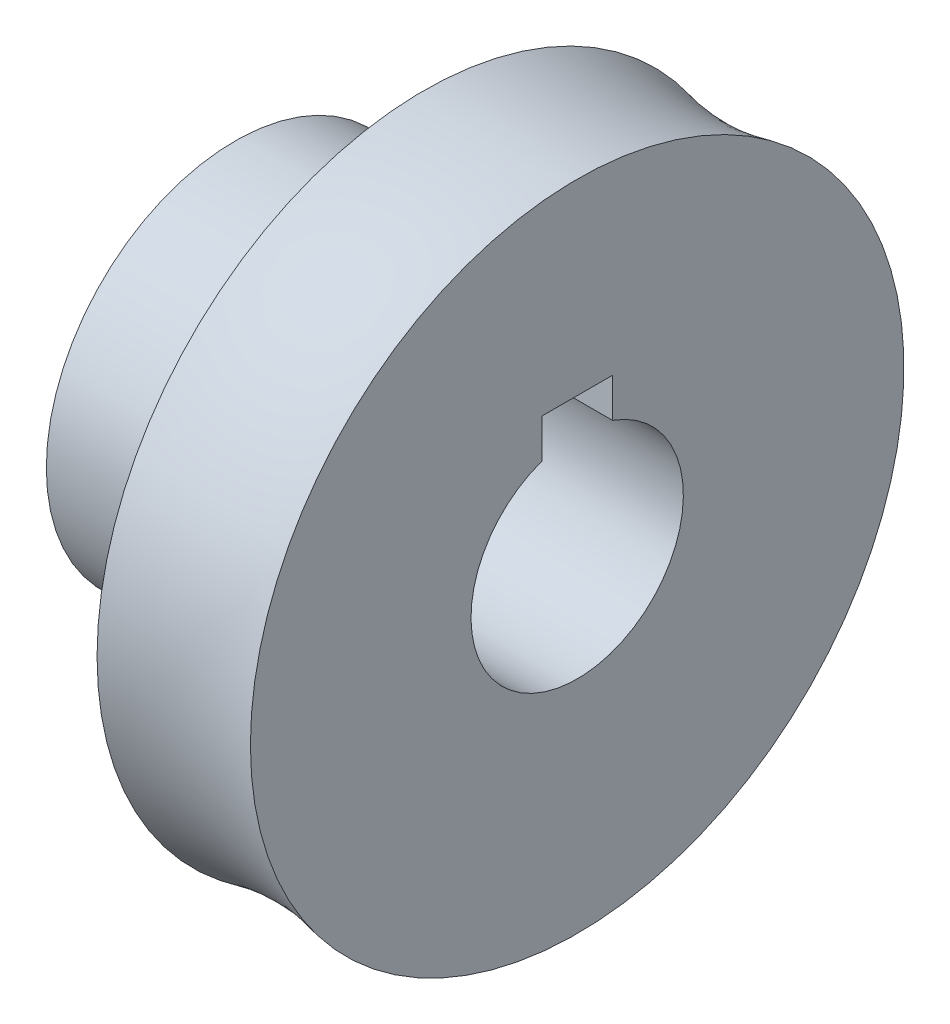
ISO-10303-21;
HEADER;
FILE_DESCRIPTION(('STEP AP214'),'2;1');
FILE_NAME('part.step','',(''),(''),'','','');
FILE_SCHEMA(('AUTOMOTIVE_DESIGN { 1 0 10303 214 1 1 1 1 }'));
ENDSEC;
DATA;
#1=APPLICATION_CONTEXT('core data for automotive mechanical design processes');
#2=APPLICATION_PROTOCOL_DEFINITION('international standard','automotive_design',2000,#1);
#3=PRODUCT_CONTEXT('',#1,'mechanical');
#4=PRODUCT('Part','Part','',(#3));
#5=PRODUCT_RELATED_PRODUCT_CATEGORY('part','',(#4));
#6=PRODUCT_DEFINITION_FORMATION('','',#4);
#7=PRODUCT_DEFINITION_CONTEXT('part definition',#1,'design');
#8=PRODUCT_DEFINITION('design','',#6,#7);
#9=PRODUCT_DEFINITION_SHAPE('','',#8);
#10=(LENGTH_UNIT() NAMED_UNIT(*) SI_UNIT(.MILLI.,.METRE.));
#11=(NAMED_UNIT(*) PLANE_ANGLE_UNIT() SI_UNIT($,.RADIAN.));
#12=(NAMED_UNIT(*) SI_UNIT($,.STERADIAN.) SOLID_ANGLE_UNIT());
#13=UNCERTAINTY_MEASURE_WITH_UNIT(LENGTH_MEASURE(1.E-05),#10,'distance_accuracy_value','');
#14=(GEOMETRIC_REPRESENTATION_CONTEXT(3) GLOBAL_UNCERTAINTY_ASSIGNED_CONTEXT((#13)) GLOBAL_UNIT_ASSIGNED_CONTEXT((#10,
#11,#12)) REPRESENTATION_CONTEXT('',''));
#15=CARTESIAN_POINT('',(0.,0.,0.));
#16=DIRECTION('',(0.,0.,1.));
#17=DIRECTION('',(1.,0.,0.));
#18=AXIS2_PLACEMENT_3D('',#15,#16,#17);
#19=CARTESIAN_POINT('',(0.,4.5,0.));
#20=DIRECTION('',(1.,0.,0.));
#21=DIRECTION('',(0.,0.,-1.));
#22=AXIS2_PLACEMENT_3D('',#19,#20,#21);
#23=PLANE('',#22);
#24=DIRECTION('',(0.,0.,1.));
#25=VECTOR('',#24,1.);
#26=CARTESIAN_POINT('',(0.,5.9,1.5));
#27=LINE('',#26,#25);
#28=CARTESIAN_POINT('',(0.,5.9,-1.5));
#29=VERTEX_POINT('',#28);
#30=CARTESIAN_POINT('',(0.,5.9,1.5));
#31=VERTEX_POINT('',#30);
#32=EDGE_CURVE('E87',#29,#31,#27,.T.);
#33=ORIENTED_EDGE('',*,*,#32,.T.);
#34=DIRECTION('',(0.,-1.,0.));
#35=VECTOR('',#34,1.);
#36=CARTESIAN_POINT('',(0.,5.9,1.5));
#37=LINE('',#36,#35);
#38=CARTESIAN_POINT('',(0.,4.24264068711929,1.5));
#39=VERTEX_POINT('',#38);
#40=EDGE_CURVE('E93',#31,#39,#37,.T.);
#41=ORIENTED_EDGE('',*,*,#40,.T.);
#42=CARTESIAN_POINT('',(0.,0.,0.));
#43=DIRECTION('',(-1.,0.,0.));
#44=DIRECTION('',(0.,0.,1.));
#45=AXIS2_PLACEMENT_3D('',#42,#43,#44);
#46=CIRCLE('',#45,4.5);
#47=CARTESIAN_POINT('',(0.,4.24264068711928,-1.5));
#48=VERTEX_POINT('',#47);
#49=EDGE_CURVE('E43',#48,#39,#46,.T.);
#50=ORIENTED_EDGE('',*,*,#49,.F.);
#51=DIRECTION('',(0.,1.,0.));
#52=VECTOR('',#51,1.);
#53=CARTESIAN_POINT('',(0.,5.9,-1.5));
#54=LINE('',#53,#52);
#55=EDGE_CURVE('E95',#48,#29,#54,.T.);
#56=ORIENTED_EDGE('',*,*,#55,.T.);
#57=EDGE_LOOP('',(#33,#41,#50,#56));
#58=FACE_BOUND('',#57,.T.);
#59=CARTESIAN_POINT('',(0.,0.,0.));
#60=DIRECTION('',(-1.,0.,0.));
#61=DIRECTION('',(0.,0.,1.));
#62=AXIS2_PLACEMENT_3D('',#59,#60,#61);
#63=CIRCLE('',#62,8.);
#64=CARTESIAN_POINT('',(0.,0.,8.));
#65=VERTEX_POINT('',#64);
#66=EDGE_CURVE('E104',#65,#65,#63,.T.);
#67=ORIENTED_EDGE('',*,*,#66,.T.);
#68=EDGE_LOOP('',(#67));
#69=FACE_BOUND('',#68,.T.);
#70=ADVANCED_FACE('F36',(#58,#69),#23,.F.);
#71=CARTESIAN_POINT('',(0.,0.,0.));
#72=DIRECTION('',(-1.,0.,0.));
#73=DIRECTION('',(0.,0.,1.));
#74=AXIS2_PLACEMENT_3D('',#71,#72,#73);
#75=CYLINDRICAL_SURFACE('',#74,4.5);
#76=ORIENTED_EDGE('',*,*,#49,.T.);
#77=DIRECTION('',(-1.,0.,0.));
#78=VECTOR('',#77,1.);
#79=CARTESIAN_POINT('',(0.,4.24264068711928,1.5));
#80=LINE('',#79,#78);
#81=CARTESIAN_POINT('',(14.5,4.24264068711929,1.5));
#82=VERTEX_POINT('',#81);
#83=EDGE_CURVE('E57',#39,#82,#80,.F.);
#84=ORIENTED_EDGE('',*,*,#83,.T.);
#85=CARTESIAN_POINT('',(14.5,0.,0.));
#86=DIRECTION('',(-1.,0.,0.));
#87=DIRECTION('',(0.,0.,1.));
#88=AXIS2_PLACEMENT_3D('',#85,#86,#87);
#89=CIRCLE('',#88,4.5);
#90=CARTESIAN_POINT('',(14.5,4.24264068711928,-1.5));
#91=VERTEX_POINT('',#90);
#92=EDGE_CURVE('E116',#91,#82,#89,.T.);
#93=ORIENTED_EDGE('',*,*,#92,.F.);
#94=DIRECTION('',(-1.,0.,0.));
#95=VECTOR('',#94,1.);
#96=CARTESIAN_POINT('',(0.,4.24264068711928,-1.5));
#97=LINE('',#96,#95);
#98=EDGE_CURVE('E50',#91,#48,#97,.T.);
#99=ORIENTED_EDGE('',*,*,#98,.T.);
#100=EDGE_LOOP('',(#76,#84,#93,#99));
#101=FACE_BOUND('',#100,.T.);
#102=ADVANCED_FACE('F120',(#101),#75,.F.);
#103=CARTESIAN_POINT('',(14.5,4.5,0.));
#104=DIRECTION('',(-1.,0.,0.));
#105=DIRECTION('',(0.,0.,1.));
#106=AXIS2_PLACEMENT_3D('',#103,#104,#105);
#107=PLANE('',#106);
#108=CARTESIAN_POINT('',(14.5,0.,0.));
#109=DIRECTION('',(-1.,0.,0.));
#110=DIRECTION('',(0.,0.,1.));
#111=AXIS2_PLACEMENT_3D('',#108,#109,#110);
#112=CIRCLE('',#111,13.85);
#113=CARTESIAN_POINT('',(14.5,0.,13.85));
#114=VERTEX_POINT('',#113);
#115=EDGE_CURVE('E113',#114,#114,#112,.T.);
#116=ORIENTED_EDGE('',*,*,#115,.F.);
#117=EDGE_LOOP('',(#116));
#118=FACE_BOUND('',#117,.T.);
#119=ORIENTED_EDGE('',*,*,#92,.T.);
#120=DIRECTION('',(0.,-1.,0.));
#121=VECTOR('',#120,1.);
#122=CARTESIAN_POINT('',(14.5,5.9,1.5));
#123=LINE('',#122,#121);
#124=CARTESIAN_POINT('',(14.5,5.9,1.5));
#125=VERTEX_POINT('',#124);
#126=EDGE_CURVE('E92',#125,#82,#123,.T.);
#127=ORIENTED_EDGE('',*,*,#126,.F.);
#128=DIRECTION('',(0.,0.,1.));
#129=VECTOR('',#128,1.);
#130=CARTESIAN_POINT('',(14.5,5.9,1.5));
#131=LINE('',#130,#129);
#132=CARTESIAN_POINT('',(14.5,5.9,-1.5));
#133=VERTEX_POINT('',#132);
#134=EDGE_CURVE('E84',#133,#125,#131,.T.);
#135=ORIENTED_EDGE('',*,*,#134,.F.);
#136=DIRECTION('',(0.,-1.,0.));
#137=VECTOR('',#136,1.);
#138=CARTESIAN_POINT('',(14.5,4.5,-1.5));
#139=LINE('',#138,#137);
#140=EDGE_CURVE('E11',#133,#91,#139,.T.);
#141=ORIENTED_EDGE('',*,*,#140,.T.);
#142=EDGE_LOOP('',(#119,#127,#135,#141));
#143=FACE_BOUND('',#142,.T.);
#144=ADVANCED_FACE('F91',(#118,#143),#107,.F.);
#145=CARTESIAN_POINT('',(11.25,0.,0.));
#146=DIRECTION('',(-1.,0.,0.));
#147=DIRECTION('',(0.,0.,1.));
#148=AXIS2_PLACEMENT_3D('',#145,#146,#147);
#149=TOROIDAL_SURFACE('',#148,27.4675438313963,14.);
#150=CARTESIAN_POINT('',(8.,0.,0.));
#151=DIRECTION('',(-1.,0.,0.));
#152=DIRECTION('',(0.,0.,1.));
#153=AXIS2_PLACEMENT_3D('',#150,#151,#152);
#154=CIRCLE('',#153,13.85);
#155=CARTESIAN_POINT('',(8.,0.,13.85));
#156=VERTEX_POINT('',#155);
#157=EDGE_CURVE('E110',#156,#156,#154,.T.);
#158=ORIENTED_EDGE('',*,*,#157,.F.);
#159=EDGE_LOOP('',(#158));
#160=FACE_BOUND('',#159,.T.);
#161=ORIENTED_EDGE('',*,*,#115,.T.);
#162=EDGE_LOOP('',(#161));
#163=FACE_BOUND('',#162,.T.);
#164=ADVANCED_FACE('F142',(#160,#163),#149,.F.);
#165=CARTESIAN_POINT('',(8.,8.,0.));
#166=DIRECTION('',(1.,0.,0.));
#167=DIRECTION('',(0.,0.,-1.));
#168=AXIS2_PLACEMENT_3D('',#165,#166,#167);
#169=PLANE('',#168);
#170=CARTESIAN_POINT('',(8.,0.,0.));
#171=DIRECTION('',(-1.,0.,0.));
#172=DIRECTION('',(0.,0.,1.));
#173=AXIS2_PLACEMENT_3D('',#170,#171,#172);
#174=CIRCLE('',#173,8.);
#175=CARTESIAN_POINT('',(8.,0.,8.));
#176=VERTEX_POINT('',#175);
#177=EDGE_CURVE('E107',#176,#176,#174,.T.);
#178=ORIENTED_EDGE('',*,*,#177,.F.);
#179=EDGE_LOOP('',(#178));
#180=FACE_BOUND('',#179,.T.);
#181=ORIENTED_EDGE('',*,*,#157,.T.);
#182=EDGE_LOOP('',(#181));
#183=FACE_BOUND('',#182,.T.);
#184=ADVANCED_FACE('F132',(#180,#183),#169,.F.);
#185=CARTESIAN_POINT('',(0.,0.,0.));
#186=DIRECTION('',(-1.,0.,0.));
#187=DIRECTION('',(0.,0.,1.));
#188=AXIS2_PLACEMENT_3D('',#185,#186,#187);
#189=CYLINDRICAL_SURFACE('',#188,8.);
#190=ORIENTED_EDGE('',*,*,#66,.F.);
#191=EDGE_LOOP('',(#190));
#192=FACE_BOUND('',#191,.T.);
#193=ORIENTED_EDGE('',*,*,#177,.T.);
#194=EDGE_LOOP('',(#193));
#195=FACE_BOUND('',#194,.T.);
#196=ADVANCED_FACE('F125',(#192,#195),#189,.T.);
#197=CARTESIAN_POINT('',(0.,5.9,1.5));
#198=DIRECTION('',(0.,0.,1.));
#199=DIRECTION('',(0.,-1.,0.));
#200=AXIS2_PLACEMENT_3D('',#197,#198,#199);
#201=PLANE('',#200);
#202=ORIENTED_EDGE('',*,*,#40,.F.);
#203=DIRECTION('',(1.,0.,0.));
#204=VECTOR('',#203,1.);
#205=CARTESIAN_POINT('',(0.,5.9,1.5));
#206=LINE('',#205,#204);
#207=EDGE_CURVE('E89',#31,#125,#206,.T.);
#208=ORIENTED_EDGE('',*,*,#207,.T.);
#209=ORIENTED_EDGE('',*,*,#126,.T.);
#210=ORIENTED_EDGE('',*,*,#83,.F.);
#211=EDGE_LOOP('',(#202,#208,#209,#210));
#212=FACE_BOUND('',#211,.T.);
#213=ADVANCED_FACE('F123',(#212),#201,.F.);
#214=CARTESIAN_POINT('',(0.,5.9,-1.5));
#215=DIRECTION('',(0.,0.,-1.));
#216=DIRECTION('',(0.,1.,0.));
#217=AXIS2_PLACEMENT_3D('',#214,#215,#216);
#218=PLANE('',#217);
#219=ORIENTED_EDGE('',*,*,#140,.F.);
#220=DIRECTION('',(1.,0.,0.));
#221=VECTOR('',#220,1.);
#222=CARTESIAN_POINT('',(0.,5.9,-1.5));
#223=LINE('',#222,#221);
#224=EDGE_CURVE('E75',#29,#133,#223,.T.);
#225=ORIENTED_EDGE('',*,*,#224,.F.);
#226=ORIENTED_EDGE('',*,*,#55,.F.);
#227=ORIENTED_EDGE('',*,*,#98,.F.);
#228=EDGE_LOOP('',(#219,#225,#226,#227));
#229=FACE_BOUND('',#228,.T.);
#230=ADVANCED_FACE('F74',(#229),#218,.F.);
#231=CARTESIAN_POINT('',(0.,5.9,1.5));
#232=DIRECTION('',(0.,1.,0.));
#233=DIRECTION('',(0.,0.,1.));
#234=AXIS2_PLACEMENT_3D('',#231,#232,#233);
#235=PLANE('',#234);
#236=ORIENTED_EDGE('',*,*,#134,.T.);
#237=ORIENTED_EDGE('',*,*,#207,.F.);
#238=ORIENTED_EDGE('',*,*,#32,.F.);
#239=ORIENTED_EDGE('',*,*,#224,.T.);
#240=EDGE_LOOP('',(#236,#237,#238,#239));
#241=FACE_BOUND('',#240,.T.);
#242=ADVANCED_FACE('F83',(#241),#235,.F.);
#243=CLOSED_SHELL('',(#70,#102,#144,#164,#184,#196,#213,#230,#242));
#244=MANIFOLD_SOLID_BREP('B2',#243);
#245=ADVANCED_BREP_SHAPE_REPRESENTATION('',(#18,#244),#14);
#246=SHAPE_DEFINITION_REPRESENTATION(#9,#245);
ENDSEC;
END-ISO-10303-21;
